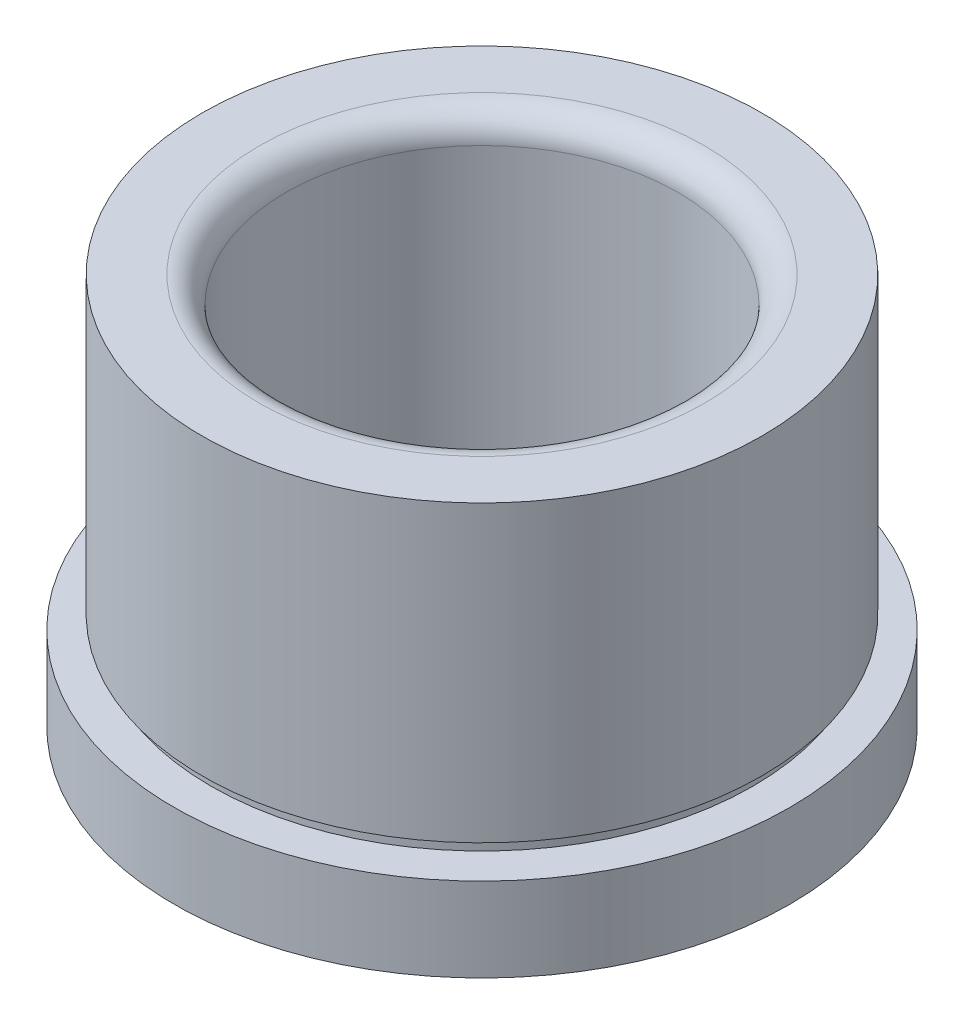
ISO-10303-21;
HEADER;
FILE_DESCRIPTION(('STEP AP214'),'2;1');
FILE_NAME('part.step','',(''),(''),'','','');
FILE_SCHEMA(('AUTOMOTIVE_DESIGN { 1 0 10303 214 1 1 1 1 }'));
ENDSEC;
DATA;
#1=APPLICATION_CONTEXT('core data for automotive mechanical design processes');
#2=APPLICATION_PROTOCOL_DEFINITION('international standard','automotive_design',2000,#1);
#3=PRODUCT_CONTEXT('',#1,'mechanical');
#4=PRODUCT('Part','Part','',(#3));
#5=PRODUCT_RELATED_PRODUCT_CATEGORY('part','',(#4));
#6=PRODUCT_DEFINITION_FORMATION('','',#4);
#7=PRODUCT_DEFINITION_CONTEXT('part definition',#1,'design');
#8=PRODUCT_DEFINITION('design','',#6,#7);
#9=PRODUCT_DEFINITION_SHAPE('','',#8);
#10=(LENGTH_UNIT() NAMED_UNIT(*) SI_UNIT(.MILLI.,.METRE.));
#11=(NAMED_UNIT(*) PLANE_ANGLE_UNIT() SI_UNIT($,.RADIAN.));
#12=(NAMED_UNIT(*) SI_UNIT($,.STERADIAN.) SOLID_ANGLE_UNIT());
#13=UNCERTAINTY_MEASURE_WITH_UNIT(LENGTH_MEASURE(1.E-05),#10,'distance_accuracy_value','');
#14=(GEOMETRIC_REPRESENTATION_CONTEXT(3) GLOBAL_UNCERTAINTY_ASSIGNED_CONTEXT((#13)) GLOBAL_UNIT_ASSIGNED_CONTEXT((#10,
#11,#12)) REPRESENTATION_CONTEXT('',''));
#15=CARTESIAN_POINT('',(0.,0.,0.));
#16=DIRECTION('',(0.,0.,1.));
#17=DIRECTION('',(1.,0.,0.));
#18=AXIS2_PLACEMENT_3D('',#15,#16,#17);
#19=CARTESIAN_POINT('',(-15.88135,38.1506908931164,0.));
#20=DIRECTION('',(0.,-1.,0.));
#21=DIRECTION('',(1.,0.,0.));
#22=AXIS2_PLACEMENT_3D('',#19,#20,#21);
#23=PLANE('',#22);
#24=CARTESIAN_POINT('',(-1.33202502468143E-13,38.1506908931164,0.));
#25=DIRECTION('',(0.,-1.,0.));
#26=DIRECTION('',(1.,0.,0.));
#27=AXIS2_PLACEMENT_3D('',#24,#25,#26);
#28=CIRCLE('',#27,12.6428499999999);
#29=CARTESIAN_POINT('',(12.6428499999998,38.1506908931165,0.));
#30=VERTEX_POINT('',#29);
#31=EDGE_CURVE('E35',#30,#30,#28,.T.);
#32=ORIENTED_EDGE('',*,*,#31,.T.);
#33=EDGE_LOOP('',(#32));
#34=FACE_BOUND('',#33,.T.);
#35=CARTESIAN_POINT('',(-1.33202502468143E-13,38.1506908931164,0.));
#36=DIRECTION('',(0.,-1.,0.));
#37=DIRECTION('',(1.,0.,0.));
#38=AXIS2_PLACEMENT_3D('',#35,#36,#37);
#39=CIRCLE('',#38,15.8813499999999);
#40=CARTESIAN_POINT('',(15.8813499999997,38.1506908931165,0.));
#41=VERTEX_POINT('',#40);
#42=EDGE_CURVE('E39',#41,#41,#39,.T.);
#43=ORIENTED_EDGE('',*,*,#42,.F.);
#44=EDGE_LOOP('',(#43));
#45=FACE_BOUND('',#44,.T.);
#46=ADVANCED_FACE('F28',(#34,#45),#23,.F.);
#47=CARTESIAN_POINT('',(3.49148336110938E-12,-1000.,0.));
#48=DIRECTION('',(0.,-1.,0.));
#49=DIRECTION('',(1.,0.,0.));
#50=AXIS2_PLACEMENT_3D('',#47,#48,#49);
#51=CYLINDRICAL_SURFACE('',#50,15.8813499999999);
#52=CARTESIAN_POINT('',(0.,21.4501908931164,0.));
#53=DIRECTION('',(0.,-1.,0.));
#54=DIRECTION('',(1.,0.,0.));
#55=AXIS2_PLACEMENT_3D('',#52,#53,#54);
#56=CIRCLE('',#55,15.8813499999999);
#57=CARTESIAN_POINT('',(15.8813499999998,21.4501908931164,0.));
#58=VERTEX_POINT('',#57);
#59=EDGE_CURVE('E43',#58,#58,#56,.T.);
#60=ORIENTED_EDGE('',*,*,#59,.F.);
#61=EDGE_LOOP('',(#60));
#62=FACE_BOUND('',#61,.T.);
#63=ORIENTED_EDGE('',*,*,#42,.T.);
#64=EDGE_LOOP('',(#63));
#65=FACE_BOUND('',#64,.T.);
#66=ADVANCED_FACE('F102',(#62,#65),#51,.T.);
#67=CARTESIAN_POINT('',(-15.88135,21.4501908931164,0.));
#68=DIRECTION('',(0.,1.,0.));
#69=DIRECTION('',(-1.,0.,0.));
#70=AXIS2_PLACEMENT_3D('',#67,#68,#69);
#71=PLANE('',#70);
#72=CARTESIAN_POINT('',(0.,21.4501908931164,0.));
#73=DIRECTION('',(0.,-1.,0.));
#74=DIRECTION('',(1.,0.,0.));
#75=AXIS2_PLACEMENT_3D('',#72,#73,#74);
#76=CIRCLE('',#75,15.3733499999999);
#77=CARTESIAN_POINT('',(15.3733499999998,21.4501908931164,0.));
#78=VERTEX_POINT('',#77);
#79=EDGE_CURVE('E48',#78,#78,#76,.T.);
#80=ORIENTED_EDGE('',*,*,#79,.F.);
#81=EDGE_LOOP('',(#80));
#82=FACE_BOUND('',#81,.T.);
#83=ORIENTED_EDGE('',*,*,#59,.T.);
#84=EDGE_LOOP('',(#83));
#85=FACE_BOUND('',#84,.T.);
#86=ADVANCED_FACE('F96',(#82,#85),#71,.F.);
#87=CARTESIAN_POINT('',(3.49148336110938E-12,-1000.,0.));
#88=DIRECTION('',(0.,-1.,0.));
#89=DIRECTION('',(1.,0.,0.));
#90=AXIS2_PLACEMENT_3D('',#87,#88,#89);
#91=CYLINDRICAL_SURFACE('',#90,15.3733499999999);
#92=CARTESIAN_POINT('',(0.,20.6881908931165,0.));
#93=DIRECTION('',(0.,-1.,0.));
#94=DIRECTION('',(1.,0.,0.));
#95=AXIS2_PLACEMENT_3D('',#92,#93,#94);
#96=CIRCLE('',#95,15.3733499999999);
#97=CARTESIAN_POINT('',(15.3733499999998,20.6881908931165,0.));
#98=VERTEX_POINT('',#97);
#99=EDGE_CURVE('E51',#98,#98,#96,.T.);
#100=ORIENTED_EDGE('',*,*,#99,.F.);
#101=EDGE_LOOP('',(#100));
#102=FACE_BOUND('',#101,.T.);
#103=ORIENTED_EDGE('',*,*,#79,.T.);
#104=EDGE_LOOP('',(#103));
#105=FACE_BOUND('',#104,.T.);
#106=ADVANCED_FACE('F90',(#102,#105),#91,.T.);
#107=CARTESIAN_POINT('',(-17.4625,20.6881908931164,0.));
#108=DIRECTION('',(0.,-1.,0.));
#109=DIRECTION('',(1.,0.,0.));
#110=AXIS2_PLACEMENT_3D('',#107,#108,#109);
#111=PLANE('',#110);
#112=CARTESIAN_POINT('',(0.,20.6881908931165,0.));
#113=DIRECTION('',(0.,-1.,0.));
#114=DIRECTION('',(1.,0.,0.));
#115=AXIS2_PLACEMENT_3D('',#112,#113,#114);
#116=CIRCLE('',#115,17.4624999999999);
#117=CARTESIAN_POINT('',(17.4624999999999,20.6881908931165,0.));
#118=VERTEX_POINT('',#117);
#119=EDGE_CURVE('E54',#118,#118,#116,.T.);
#120=ORIENTED_EDGE('',*,*,#119,.F.);
#121=EDGE_LOOP('',(#120));
#122=FACE_BOUND('',#121,.T.);
#123=ORIENTED_EDGE('',*,*,#99,.T.);
#124=EDGE_LOOP('',(#123));
#125=FACE_BOUND('',#124,.T.);
#126=ADVANCED_FACE('F84',(#122,#125),#111,.F.);
#127=CARTESIAN_POINT('',(3.49148336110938E-12,-1000.,0.));
#128=DIRECTION('',(0.,-1.,0.));
#129=DIRECTION('',(1.,0.,0.));
#130=AXIS2_PLACEMENT_3D('',#127,#128,#129);
#131=CYLINDRICAL_SURFACE('',#130,17.4624999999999);
#132=CARTESIAN_POINT('',(0.,15.9256908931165,0.));
#133=DIRECTION('',(0.,-1.,0.));
#134=DIRECTION('',(1.,0.,0.));
#135=AXIS2_PLACEMENT_3D('',#132,#133,#134);
#136=CIRCLE('',#135,17.4624999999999);
#137=CARTESIAN_POINT('',(17.4624999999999,15.9256908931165,0.));
#138=VERTEX_POINT('',#137);
#139=EDGE_CURVE('E57',#138,#138,#136,.T.);
#140=ORIENTED_EDGE('',*,*,#139,.F.);
#141=EDGE_LOOP('',(#140));
#142=FACE_BOUND('',#141,.T.);
#143=ORIENTED_EDGE('',*,*,#119,.T.);
#144=EDGE_LOOP('',(#143));
#145=FACE_BOUND('',#144,.T.);
#146=ADVANCED_FACE('F78',(#142,#145),#131,.T.);
#147=CARTESIAN_POINT('',(-11.9349055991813,15.9256908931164,0.));
#148=DIRECTION('',(0.,1.,0.));
#149=DIRECTION('',(-1.,0.,0.));
#150=AXIS2_PLACEMENT_3D('',#147,#148,#149);
#151=PLANE('',#150);
#152=CARTESIAN_POINT('',(0.,15.9256908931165,0.));
#153=DIRECTION('',(0.,-1.,0.));
#154=DIRECTION('',(1.,0.,0.));
#155=AXIS2_PLACEMENT_3D('',#152,#153,#154);
#156=CIRCLE('',#155,11.9349055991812);
#157=CARTESIAN_POINT('',(11.9349055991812,15.9256908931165,0.));
#158=VERTEX_POINT('',#157);
#159=EDGE_CURVE('E60',#158,#158,#156,.T.);
#160=ORIENTED_EDGE('',*,*,#159,.F.);
#161=EDGE_LOOP('',(#160));
#162=FACE_BOUND('',#161,.T.);
#163=ORIENTED_EDGE('',*,*,#139,.T.);
#164=EDGE_LOOP('',(#163));
#165=FACE_BOUND('',#164,.T.);
#166=ADVANCED_FACE('F72',(#162,#165),#151,.F.);
#167=CARTESIAN_POINT('',(0.,15.9256908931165,0.));
#168=DIRECTION('',(0.,-1.,0.));
#169=DIRECTION('',(1.,0.,0.));
#170=AXIS2_PLACEMENT_3D('',#167,#168,#169);
#171=CONICAL_SURFACE('',#170,11.9349055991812,0.785398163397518);
#172=CARTESIAN_POINT('',(0.,16.7417464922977,0.));
#173=DIRECTION('',(0.,-1.,0.));
#174=DIRECTION('',(1.,0.,0.));
#175=AXIS2_PLACEMENT_3D('',#172,#173,#174);
#176=CIRCLE('',#175,11.1188499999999);
#177=CARTESIAN_POINT('',(11.1188499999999,16.7417464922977,0.));
#178=VERTEX_POINT('',#177);
#179=EDGE_CURVE('E63',#178,#178,#176,.T.);
#180=ORIENTED_EDGE('',*,*,#179,.F.);
#181=EDGE_LOOP('',(#180));
#182=FACE_BOUND('',#181,.T.);
#183=ORIENTED_EDGE('',*,*,#159,.T.);
#184=EDGE_LOOP('',(#183));
#185=FACE_BOUND('',#184,.T.);
#186=ADVANCED_FACE('F69',(#182,#185),#171,.F.);
#187=CARTESIAN_POINT('',(3.49148336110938E-12,-1000.,0.));
#188=DIRECTION('',(0.,-1.,0.));
#189=DIRECTION('',(1.,0.,0.));
#190=AXIS2_PLACEMENT_3D('',#187,#188,#189);
#191=CYLINDRICAL_SURFACE('',#190,11.1188499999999);
#192=CARTESIAN_POINT('',(-1.27881481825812E-13,36.6266908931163,0.));
#193=DIRECTION('',(0.,-1.,0.));
#194=DIRECTION('',(1.,0.,0.));
#195=AXIS2_PLACEMENT_3D('',#192,#193,#194);
#196=CIRCLE('',#195,11.1188499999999);
#197=CARTESIAN_POINT('',(11.1188499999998,36.6266908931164,0.));
#198=VERTEX_POINT('',#197);
#199=EDGE_CURVE('E10',#198,#198,#196,.F.);
#200=ORIENTED_EDGE('',*,*,#199,.T.);
#201=EDGE_LOOP('',(#200));
#202=FACE_BOUND('',#201,.T.);
#203=ORIENTED_EDGE('',*,*,#179,.T.);
#204=EDGE_LOOP('',(#203));
#205=FACE_BOUND('',#204,.T.);
#206=ADVANCED_FACE('F67',(#202,#205),#191,.F.);
#207=CARTESIAN_POINT('',(-1.27881481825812E-13,36.6266908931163,0.));
#208=DIRECTION('',(0.,-1.,0.));
#209=DIRECTION('',(1.,0.,0.));
#210=AXIS2_PLACEMENT_3D('',#207,#208,#209);
#211=TOROIDAL_SURFACE('',#210,12.6428499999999,1.524);
#212=ORIENTED_EDGE('',*,*,#199,.F.);
#213=EDGE_LOOP('',(#212));
#214=FACE_BOUND('',#213,.T.);
#215=ORIENTED_EDGE('',*,*,#31,.F.);
#216=EDGE_LOOP('',(#215));
#217=FACE_BOUND('',#216,.T.);
#218=ADVANCED_FACE('F30',(#214,#217),#211,.T.);
#219=CLOSED_SHELL('',(#46,#66,#86,#106,#126,#146,#166,#186,#206,#218));
#220=MANIFOLD_SOLID_BREP('B2',#219);
#221=ADVANCED_BREP_SHAPE_REPRESENTATION('',(#18,#220),#14);
#222=SHAPE_DEFINITION_REPRESENTATION(#9,#221);
ENDSEC;
END-ISO-10303-21;
